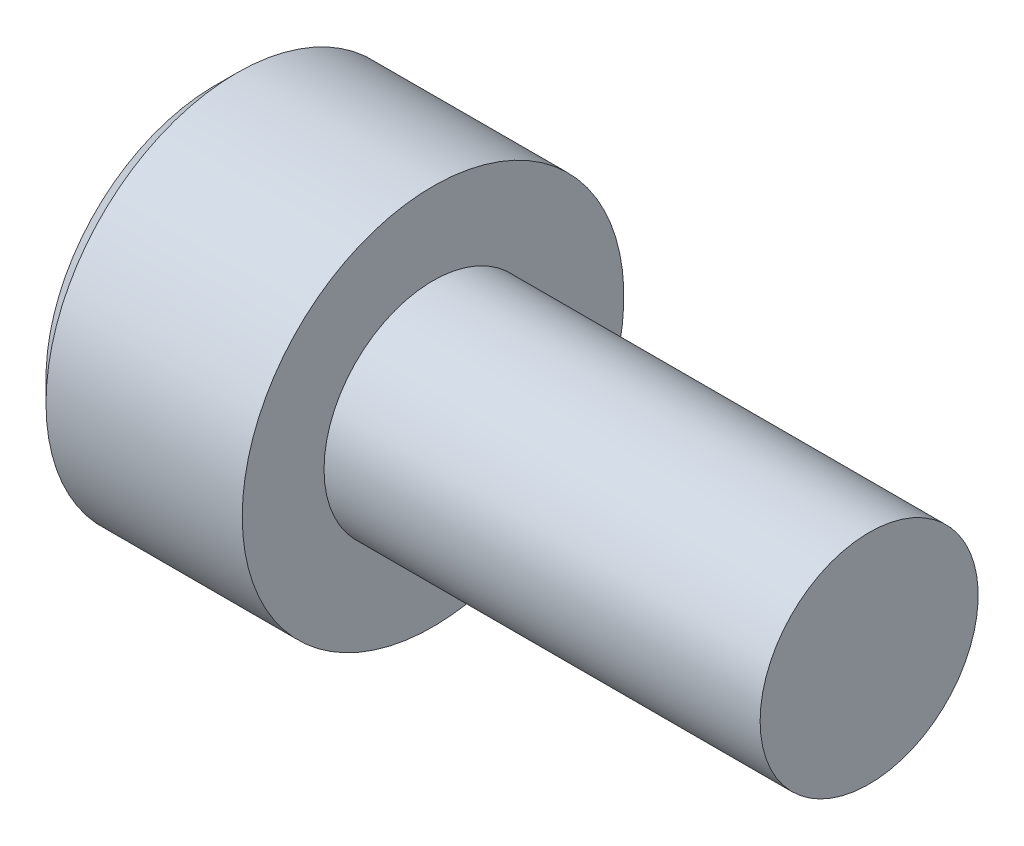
ISO-10303-21;
HEADER;
FILE_DESCRIPTION(('STEP AP214'),'2;1');
FILE_NAME('part.step','',(''),(''),'','','');
FILE_SCHEMA(('AUTOMOTIVE_DESIGN { 1 0 10303 214 1 1 1 1 }'));
ENDSEC;
DATA;
#1=APPLICATION_CONTEXT('core data for automotive mechanical design processes');
#2=APPLICATION_PROTOCOL_DEFINITION('international standard','automotive_design',2000,#1);
#3=PRODUCT_CONTEXT('',#1,'mechanical');
#4=PRODUCT('Part','Part','',(#3));
#5=PRODUCT_RELATED_PRODUCT_CATEGORY('part','',(#4));
#6=PRODUCT_DEFINITION_FORMATION('','',#4);
#7=PRODUCT_DEFINITION_CONTEXT('part definition',#1,'design');
#8=PRODUCT_DEFINITION('design','',#6,#7);
#9=PRODUCT_DEFINITION_SHAPE('','',#8);
#10=(LENGTH_UNIT() NAMED_UNIT(*) SI_UNIT(.MILLI.,.METRE.));
#11=(NAMED_UNIT(*) PLANE_ANGLE_UNIT() SI_UNIT($,.RADIAN.));
#12=(NAMED_UNIT(*) SI_UNIT($,.STERADIAN.) SOLID_ANGLE_UNIT());
#13=UNCERTAINTY_MEASURE_WITH_UNIT(LENGTH_MEASURE(1.E-05),#10,'distance_accuracy_value','');
#14=(GEOMETRIC_REPRESENTATION_CONTEXT(3) GLOBAL_UNCERTAINTY_ASSIGNED_CONTEXT((#13)) GLOBAL_UNIT_ASSIGNED_CONTEXT((#10,
#11,#12)) REPRESENTATION_CONTEXT('',''));
#15=CARTESIAN_POINT('',(0.,0.,0.));
#16=DIRECTION('',(0.,0.,1.));
#17=DIRECTION('',(1.,0.,0.));
#18=AXIS2_PLACEMENT_3D('',#15,#16,#17);
#19=CARTESIAN_POINT('',(-4.,3.5,0.));
#20=DIRECTION('',(1.,0.,0.));
#21=DIRECTION('',(0.,0.,-1.));
#22=AXIS2_PLACEMENT_3D('',#19,#20,#21);
#23=PLANE('',#22);
#24=CARTESIAN_POINT('',(-4.,0.,0.));
#25=DIRECTION('',(1.,0.,0.));
#26=DIRECTION('',(0.,0.,-1.));
#27=AXIS2_PLACEMENT_3D('',#24,#25,#26);
#28=CIRCLE('',#27,3.1);
#29=CARTESIAN_POINT('',(-4.,0.,-3.1));
#30=VERTEX_POINT('',#29);
#31=EDGE_CURVE('E45',#30,#30,#28,.F.);
#32=ORIENTED_EDGE('',*,*,#31,.T.);
#33=EDGE_LOOP('',(#32));
#34=FACE_BOUND('',#33,.T.);
#35=DIRECTION('',(0.,0.5,0.866025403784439));
#36=VECTOR('',#35,1.);
#37=CARTESIAN_POINT('',(-4.,-1.73205080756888,0.));
#38=LINE('',#37,#36);
#39=CARTESIAN_POINT('',(-4.,-1.73205080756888,0.));
#40=VERTEX_POINT('',#39);
#41=CARTESIAN_POINT('',(-4.,-0.866025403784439,1.5));
#42=VERTEX_POINT('',#41);
#43=EDGE_CURVE('E152',#40,#42,#38,.T.);
#44=ORIENTED_EDGE('',*,*,#43,.F.);
#45=DIRECTION('',(0.,-0.5,0.866025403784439));
#46=VECTOR('',#45,1.);
#47=CARTESIAN_POINT('',(-4.,-0.866025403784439,-1.5));
#48=LINE('',#47,#46);
#49=CARTESIAN_POINT('',(-4.,-0.866025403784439,-1.5));
#50=VERTEX_POINT('',#49);
#51=EDGE_CURVE('E52',#50,#40,#48,.T.);
#52=ORIENTED_EDGE('',*,*,#51,.F.);
#53=DIRECTION('',(0.,-1.,0.));
#54=VECTOR('',#53,1.);
#55=CARTESIAN_POINT('',(-4.,0.866025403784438,-1.5));
#56=LINE('',#55,#54);
#57=CARTESIAN_POINT('',(-4.,0.866025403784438,-1.5));
#58=VERTEX_POINT('',#57);
#59=EDGE_CURVE('E122',#58,#50,#56,.T.);
#60=ORIENTED_EDGE('',*,*,#59,.F.);
#61=DIRECTION('',(0.,-0.5,-0.866025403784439));
#62=VECTOR('',#61,1.);
#63=CARTESIAN_POINT('',(-4.,1.73205080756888,0.));
#64=LINE('',#63,#62);
#65=CARTESIAN_POINT('',(-4.,1.73205080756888,0.));
#66=VERTEX_POINT('',#65);
#67=EDGE_CURVE('E158',#66,#58,#64,.T.);
#68=ORIENTED_EDGE('',*,*,#67,.F.);
#69=DIRECTION('',(0.,0.499999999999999,-0.866025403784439));
#70=VECTOR('',#69,1.);
#71=CARTESIAN_POINT('',(-4.,0.866025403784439,1.5));
#72=LINE('',#71,#70);
#73=CARTESIAN_POINT('',(-4.,0.866025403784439,1.5));
#74=VERTEX_POINT('',#73);
#75=EDGE_CURVE('E156',#74,#66,#72,.T.);
#76=ORIENTED_EDGE('',*,*,#75,.F.);
#77=DIRECTION('',(0.,1.,0.));
#78=VECTOR('',#77,1.);
#79=CARTESIAN_POINT('',(-4.,-0.866025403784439,1.5));
#80=LINE('',#79,#78);
#81=EDGE_CURVE('E154',#42,#74,#80,.T.);
#82=ORIENTED_EDGE('',*,*,#81,.F.);
#83=EDGE_LOOP('',(#44,#52,#60,#68,#76,#82));
#84=FACE_BOUND('',#83,.T.);
#85=ADVANCED_FACE('F37',(#34,#84),#23,.F.);
#86=CARTESIAN_POINT('',(8.,0.,0.));
#87=DIRECTION('',(-1.,0.,0.));
#88=DIRECTION('',(0.,0.,1.));
#89=AXIS2_PLACEMENT_3D('',#86,#87,#88);
#90=PLANE('',#89);
#91=CARTESIAN_POINT('',(8.,0.,0.));
#92=DIRECTION('',(-1.,0.,0.));
#93=DIRECTION('',(0.,0.,1.));
#94=AXIS2_PLACEMENT_3D('',#91,#92,#93);
#95=CIRCLE('',#94,2.);
#96=CARTESIAN_POINT('',(8.,0.,2.));
#97=VERTEX_POINT('',#96);
#98=EDGE_CURVE('E184',#97,#97,#95,.T.);
#99=ORIENTED_EDGE('',*,*,#98,.F.);
#100=EDGE_LOOP('',(#99));
#101=FACE_BOUND('',#100,.T.);
#102=ADVANCED_FACE('F205',(#101),#90,.F.);
#103=CARTESIAN_POINT('',(-4.,0.,0.));
#104=DIRECTION('',(-1.,0.,0.));
#105=DIRECTION('',(0.,0.,1.));
#106=AXIS2_PLACEMENT_3D('',#103,#104,#105);
#107=CYLINDRICAL_SURFACE('',#106,2.);
#108=CARTESIAN_POINT('',(0.,0.,0.));
#109=DIRECTION('',(-1.,0.,0.));
#110=DIRECTION('',(0.,0.,1.));
#111=AXIS2_PLACEMENT_3D('',#108,#109,#110);
#112=CIRCLE('',#111,2.);
#113=CARTESIAN_POINT('',(0.,0.,2.));
#114=VERTEX_POINT('',#113);
#115=EDGE_CURVE('E181',#114,#114,#112,.T.);
#116=ORIENTED_EDGE('',*,*,#115,.F.);
#117=EDGE_LOOP('',(#116));
#118=FACE_BOUND('',#117,.T.);
#119=ORIENTED_EDGE('',*,*,#98,.T.);
#120=EDGE_LOOP('',(#119));
#121=FACE_BOUND('',#120,.T.);
#122=ADVANCED_FACE('F209',(#118,#121),#107,.T.);
#123=CARTESIAN_POINT('',(0.,2.,0.));
#124=DIRECTION('',(-1.,0.,0.));
#125=DIRECTION('',(0.,0.,1.));
#126=AXIS2_PLACEMENT_3D('',#123,#124,#125);
#127=PLANE('',#126);
#128=CARTESIAN_POINT('',(0.,0.,0.));
#129=DIRECTION('',(-1.,0.,0.));
#130=DIRECTION('',(0.,0.,1.));
#131=AXIS2_PLACEMENT_3D('',#128,#129,#130);
#132=CIRCLE('',#131,3.5);
#133=CARTESIAN_POINT('',(0.,0.,3.5));
#134=VERTEX_POINT('',#133);
#135=EDGE_CURVE('E177',#134,#134,#132,.T.);
#136=ORIENTED_EDGE('',*,*,#135,.F.);
#137=EDGE_LOOP('',(#136));
#138=FACE_BOUND('',#137,.T.);
#139=ORIENTED_EDGE('',*,*,#115,.T.);
#140=EDGE_LOOP('',(#139));
#141=FACE_BOUND('',#140,.T.);
#142=ADVANCED_FACE('F200',(#138,#141),#127,.F.);
#143=CARTESIAN_POINT('',(-4.,0.,0.));
#144=DIRECTION('',(-1.,0.,0.));
#145=DIRECTION('',(0.,0.,1.));
#146=AXIS2_PLACEMENT_3D('',#143,#144,#145);
#147=CYLINDRICAL_SURFACE('',#146,3.5);
#148=CARTESIAN_POINT('',(-3.6,0.,0.));
#149=DIRECTION('',(1.,0.,0.));
#150=DIRECTION('',(0.,0.,-1.));
#151=AXIS2_PLACEMENT_3D('',#148,#149,#150);
#152=CIRCLE('',#151,3.5);
#153=CARTESIAN_POINT('',(-3.6,0.,-3.5));
#154=VERTEX_POINT('',#153);
#155=EDGE_CURVE('E11',#154,#154,#152,.T.);
#156=ORIENTED_EDGE('',*,*,#155,.T.);
#157=EDGE_LOOP('',(#156));
#158=FACE_BOUND('',#157,.T.);
#159=ORIENTED_EDGE('',*,*,#135,.T.);
#160=EDGE_LOOP('',(#159));
#161=FACE_BOUND('',#160,.T.);
#162=ADVANCED_FACE('F192',(#158,#161),#147,.T.);
#163=CARTESIAN_POINT('',(-4.,0.,0.));
#164=DIRECTION('',(1.,0.,0.));
#165=DIRECTION('',(0.,0.,-1.));
#166=AXIS2_PLACEMENT_3D('',#163,#164,#165);
#167=CONICAL_SURFACE('',#166,3.1,0.785398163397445);
#168=ORIENTED_EDGE('',*,*,#155,.F.);
#169=EDGE_LOOP('',(#168));
#170=FACE_BOUND('',#169,.T.);
#171=ORIENTED_EDGE('',*,*,#31,.F.);
#172=EDGE_LOOP('',(#171));
#173=FACE_BOUND('',#172,.T.);
#174=ADVANCED_FACE('F39',(#170,#173),#167,.T.);
#175=CARTESIAN_POINT('',(-2.,-0.866025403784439,-1.5));
#176=DIRECTION('',(0.,-0.866025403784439,-0.5));
#177=DIRECTION('',(0.,0.5,-0.866025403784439));
#178=AXIS2_PLACEMENT_3D('',#175,#176,#177);
#179=PLANE('',#178);
#180=DIRECTION('',(0.,-0.5,0.866025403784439));
#181=VECTOR('',#180,1.);
#182=CARTESIAN_POINT('',(-2.,-0.866025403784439,-1.5));
#183=LINE('',#182,#181);
#184=CARTESIAN_POINT('',(-2.,-0.866025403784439,-1.5));
#185=VERTEX_POINT('',#184);
#186=CARTESIAN_POINT('',(-2.,-1.29903810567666,-0.75));
#187=VERTEX_POINT('',#186);
#188=EDGE_CURVE('E121',#185,#187,#183,.T.);
#189=ORIENTED_EDGE('',*,*,#188,.F.);
#190=DIRECTION('',(-1.,0.,0.));
#191=VECTOR('',#190,1.);
#192=CARTESIAN_POINT('',(-2.,-0.866025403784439,-1.5));
#193=LINE('',#192,#191);
#194=EDGE_CURVE('E161',#185,#50,#193,.T.);
#195=ORIENTED_EDGE('',*,*,#194,.T.);
#196=ORIENTED_EDGE('',*,*,#51,.T.);
#197=DIRECTION('',(-1.,0.,0.));
#198=VECTOR('',#197,1.);
#199=CARTESIAN_POINT('',(-2.,-1.73205080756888,0.));
#200=LINE('',#199,#198);
#201=CARTESIAN_POINT('',(-2.,-1.73205080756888,0.));
#202=VERTEX_POINT('',#201);
#203=EDGE_CURVE('E124',#202,#40,#200,.T.);
#204=ORIENTED_EDGE('',*,*,#203,.F.);
#205=EDGE_CURVE('E113',#187,#202,#183,.T.);
#206=ORIENTED_EDGE('',*,*,#205,.F.);
#207=EDGE_LOOP('',(#189,#195,#196,#204,#206));
#208=FACE_BOUND('',#207,.T.);
#209=ADVANCED_FACE('F125',(#208),#179,.F.);
#210=CARTESIAN_POINT('',(-2.,0.866025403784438,-1.5));
#211=DIRECTION('',(0.,0.,-1.));
#212=DIRECTION('',(-1.,0.,0.));
#213=AXIS2_PLACEMENT_3D('',#210,#211,#212);
#214=PLANE('',#213);
#215=DIRECTION('',(0.,-1.,0.));
#216=VECTOR('',#215,1.);
#217=CARTESIAN_POINT('',(-2.,0.866025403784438,-1.5));
#218=LINE('',#217,#216);
#219=CARTESIAN_POINT('',(-2.,0.866025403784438,-1.5));
#220=VERTEX_POINT('',#219);
#221=CARTESIAN_POINT('',(-2.,0.,-1.5));
#222=VERTEX_POINT('',#221);
#223=EDGE_CURVE('E130',#220,#222,#218,.T.);
#224=ORIENTED_EDGE('',*,*,#223,.F.);
#225=DIRECTION('',(-1.,0.,0.));
#226=VECTOR('',#225,1.);
#227=CARTESIAN_POINT('',(-2.,0.866025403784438,-1.5));
#228=LINE('',#227,#226);
#229=EDGE_CURVE('E163',#220,#58,#228,.T.);
#230=ORIENTED_EDGE('',*,*,#229,.T.);
#231=ORIENTED_EDGE('',*,*,#59,.T.);
#232=ORIENTED_EDGE('',*,*,#194,.F.);
#233=EDGE_CURVE('E148',#222,#185,#218,.T.);
#234=ORIENTED_EDGE('',*,*,#233,.F.);
#235=EDGE_LOOP('',(#224,#230,#231,#232,#234));
#236=FACE_BOUND('',#235,.T.);
#237=ADVANCED_FACE('F198',(#236),#214,.F.);
#238=CARTESIAN_POINT('',(-2.,1.73205080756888,0.));
#239=DIRECTION('',(0.,0.866025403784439,-0.5));
#240=DIRECTION('',(0.,0.5,0.866025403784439));
#241=AXIS2_PLACEMENT_3D('',#238,#239,#240);
#242=PLANE('',#241);
#243=DIRECTION('',(0.,-0.5,-0.866025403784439));
#244=VECTOR('',#243,1.);
#245=CARTESIAN_POINT('',(-2.,1.73205080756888,0.));
#246=LINE('',#245,#244);
#247=CARTESIAN_POINT('',(-2.,1.73205080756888,0.));
#248=VERTEX_POINT('',#247);
#249=CARTESIAN_POINT('',(-2.,1.29903810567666,-0.75));
#250=VERTEX_POINT('',#249);
#251=EDGE_CURVE('E145',#248,#250,#246,.T.);
#252=ORIENTED_EDGE('',*,*,#251,.F.);
#253=DIRECTION('',(-1.,0.,0.));
#254=VECTOR('',#253,1.);
#255=CARTESIAN_POINT('',(-2.,1.73205080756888,0.));
#256=LINE('',#255,#254);
#257=EDGE_CURVE('E166',#248,#66,#256,.T.);
#258=ORIENTED_EDGE('',*,*,#257,.T.);
#259=ORIENTED_EDGE('',*,*,#67,.T.);
#260=ORIENTED_EDGE('',*,*,#229,.F.);
#261=EDGE_CURVE('E144',#250,#220,#246,.T.);
#262=ORIENTED_EDGE('',*,*,#261,.F.);
#263=EDGE_LOOP('',(#252,#258,#259,#260,#262));
#264=FACE_BOUND('',#263,.T.);
#265=ADVANCED_FACE('F234',(#264),#242,.F.);
#266=CARTESIAN_POINT('',(-2.,0.866025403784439,1.5));
#267=DIRECTION('',(0.,0.866025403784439,0.5));
#268=DIRECTION('',(0.,-0.5,0.866025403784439));
#269=AXIS2_PLACEMENT_3D('',#266,#267,#268);
#270=PLANE('',#269);
#271=DIRECTION('',(0.,0.499999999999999,-0.866025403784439));
#272=VECTOR('',#271,1.);
#273=CARTESIAN_POINT('',(-2.,0.866025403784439,1.5));
#274=LINE('',#273,#272);
#275=CARTESIAN_POINT('',(-2.,0.866025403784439,1.5));
#276=VERTEX_POINT('',#275);
#277=CARTESIAN_POINT('',(-2.,1.29903810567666,0.749999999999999));
#278=VERTEX_POINT('',#277);
#279=EDGE_CURVE('E141',#276,#278,#274,.T.);
#280=ORIENTED_EDGE('',*,*,#279,.F.);
#281=DIRECTION('',(-1.,0.,0.));
#282=VECTOR('',#281,1.);
#283=CARTESIAN_POINT('',(-2.,0.866025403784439,1.5));
#284=LINE('',#283,#282);
#285=EDGE_CURVE('E169',#276,#74,#284,.T.);
#286=ORIENTED_EDGE('',*,*,#285,.T.);
#287=ORIENTED_EDGE('',*,*,#75,.T.);
#288=ORIENTED_EDGE('',*,*,#257,.F.);
#289=EDGE_CURVE('E140',#278,#248,#274,.T.);
#290=ORIENTED_EDGE('',*,*,#289,.F.);
#291=EDGE_LOOP('',(#280,#286,#287,#288,#290));
#292=FACE_BOUND('',#291,.T.);
#293=ADVANCED_FACE('F230',(#292),#270,.F.);
#294=CARTESIAN_POINT('',(-2.,-0.866025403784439,1.5));
#295=DIRECTION('',(0.,0.,1.));
#296=DIRECTION('',(1.,0.,0.));
#297=AXIS2_PLACEMENT_3D('',#294,#295,#296);
#298=PLANE('',#297);
#299=DIRECTION('',(0.,1.,0.));
#300=VECTOR('',#299,1.);
#301=CARTESIAN_POINT('',(-2.,-0.866025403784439,1.5));
#302=LINE('',#301,#300);
#303=CARTESIAN_POINT('',(-2.,-0.866025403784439,1.5));
#304=VERTEX_POINT('',#303);
#305=CARTESIAN_POINT('',(-2.,0.,1.5));
#306=VERTEX_POINT('',#305);
#307=EDGE_CURVE('E60',#304,#306,#302,.T.);
#308=ORIENTED_EDGE('',*,*,#307,.F.);
#309=DIRECTION('',(-1.,0.,0.));
#310=VECTOR('',#309,1.);
#311=CARTESIAN_POINT('',(-2.,-0.866025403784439,1.5));
#312=LINE('',#311,#310);
#313=EDGE_CURVE('E129',#304,#42,#312,.T.);
#314=ORIENTED_EDGE('',*,*,#313,.T.);
#315=ORIENTED_EDGE('',*,*,#81,.T.);
#316=ORIENTED_EDGE('',*,*,#285,.F.);
#317=EDGE_CURVE('E136',#306,#276,#302,.T.);
#318=ORIENTED_EDGE('',*,*,#317,.F.);
#319=EDGE_LOOP('',(#308,#314,#315,#316,#318));
#320=FACE_BOUND('',#319,.T.);
#321=ADVANCED_FACE('F227',(#320),#298,.F.);
#322=CARTESIAN_POINT('',(-2.,-1.73205080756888,0.));
#323=DIRECTION('',(0.,-0.866025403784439,0.5));
#324=DIRECTION('',(0.,-0.5,-0.866025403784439));
#325=AXIS2_PLACEMENT_3D('',#322,#323,#324);
#326=PLANE('',#325);
#327=DIRECTION('',(0.,0.5,0.866025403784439));
#328=VECTOR('',#327,1.);
#329=CARTESIAN_POINT('',(-2.,-1.73205080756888,0.));
#330=LINE('',#329,#328);
#331=CARTESIAN_POINT('',(-2.,-1.29903810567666,0.750000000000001));
#332=VERTEX_POINT('',#331);
#333=EDGE_CURVE('E116',#202,#332,#330,.T.);
#334=ORIENTED_EDGE('',*,*,#333,.F.);
#335=ORIENTED_EDGE('',*,*,#203,.T.);
#336=ORIENTED_EDGE('',*,*,#43,.T.);
#337=ORIENTED_EDGE('',*,*,#313,.F.);
#338=EDGE_CURVE('E135',#332,#304,#330,.T.);
#339=ORIENTED_EDGE('',*,*,#338,.F.);
#340=EDGE_LOOP('',(#334,#335,#336,#337,#339));
#341=FACE_BOUND('',#340,.T.);
#342=ADVANCED_FACE('F133',(#341),#326,.F.);
#343=CARTESIAN_POINT('',(-2.,0.,0.));
#344=DIRECTION('',(-1.,0.,0.));
#345=DIRECTION('',(0.,0.,1.));
#346=AXIS2_PLACEMENT_3D('',#343,#344,#345);
#347=PLANE('',#346);
#348=ORIENTED_EDGE('',*,*,#317,.T.);
#349=ORIENTED_EDGE('',*,*,#279,.T.);
#350=CARTESIAN_POINT('',(-2.,0.,0.));
#351=DIRECTION('',(-1.,0.,0.));
#352=DIRECTION('',(0.,-1.,0.));
#353=AXIS2_PLACEMENT_3D('',#350,#351,#352);
#354=CIRCLE('',#353,1.5);
#355=EDGE_CURVE('E178',#306,#278,#354,.T.);
#356=ORIENTED_EDGE('',*,*,#355,.F.);
#357=EDGE_LOOP('',(#348,#349,#356));
#358=FACE_BOUND('',#357,.T.);
#359=ADVANCED_FACE('F226',(#358),#347,.T.);
#360=ORIENTED_EDGE('',*,*,#289,.T.);
#361=ORIENTED_EDGE('',*,*,#251,.T.);
#362=EDGE_CURVE('E264',#278,#250,#354,.T.);
#363=ORIENTED_EDGE('',*,*,#362,.F.);
#364=EDGE_LOOP('',(#360,#361,#363));
#365=FACE_BOUND('',#364,.T.);
#366=ADVANCED_FACE('F248',(#365),#347,.T.);
#367=ORIENTED_EDGE('',*,*,#261,.T.);
#368=ORIENTED_EDGE('',*,*,#223,.T.);
#369=EDGE_CURVE('E266',#250,#222,#354,.T.);
#370=ORIENTED_EDGE('',*,*,#369,.F.);
#371=EDGE_LOOP('',(#367,#368,#370));
#372=FACE_BOUND('',#371,.T.);
#373=ADVANCED_FACE('F253',(#372),#347,.T.);
#374=ORIENTED_EDGE('',*,*,#233,.T.);
#375=ORIENTED_EDGE('',*,*,#188,.T.);
#376=EDGE_CURVE('E267',#222,#187,#354,.T.);
#377=ORIENTED_EDGE('',*,*,#376,.F.);
#378=EDGE_LOOP('',(#374,#375,#377));
#379=FACE_BOUND('',#378,.T.);
#380=ADVANCED_FACE('F246',(#379),#347,.T.);
#381=ORIENTED_EDGE('',*,*,#205,.T.);
#382=ORIENTED_EDGE('',*,*,#333,.T.);
#383=EDGE_CURVE('E118',#187,#332,#354,.T.);
#384=ORIENTED_EDGE('',*,*,#383,.F.);
#385=EDGE_LOOP('',(#381,#382,#384));
#386=FACE_BOUND('',#385,.T.);
#387=ADVANCED_FACE('F114',(#386),#347,.T.);
#388=ORIENTED_EDGE('',*,*,#338,.T.);
#389=ORIENTED_EDGE('',*,*,#307,.T.);
#390=EDGE_CURVE('E174',#332,#306,#354,.T.);
#391=ORIENTED_EDGE('',*,*,#390,.F.);
#392=EDGE_LOOP('',(#388,#389,#391));
#393=FACE_BOUND('',#392,.T.);
#394=ADVANCED_FACE('F221',(#393),#347,.T.);
#395=CARTESIAN_POINT('',(-1.09870907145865,0.,0.));
#396=DIRECTION('',(-1.,0.,0.));
#397=DIRECTION('',(0.,-1.,0.));
#398=AXIS2_PLACEMENT_3D('',#395,#396,#397);
#399=CONICAL_SURFACE('',#398,0.,1.02974425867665);
#400=ORIENTED_EDGE('',*,*,#390,.T.);
#401=ORIENTED_EDGE('',*,*,#355,.T.);
#402=ORIENTED_EDGE('',*,*,#362,.T.);
#403=ORIENTED_EDGE('',*,*,#369,.T.);
#404=ORIENTED_EDGE('',*,*,#376,.T.);
#405=ORIENTED_EDGE('',*,*,#383,.T.);
#406=EDGE_LOOP('',(#400,#401,#402,#403,#404,#405));
#407=FACE_BOUND('',#406,.T.);
#408=CARTESIAN_POINT('',(-1.09870907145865,0.,0.));
#409=VERTEX_POINT('',#408);
#410=VERTEX_LOOP('',#409);
#411=FACE_BOUND('',#410,.T.);
#412=ADVANCED_FACE('F219',(#407,#411),#399,.F.);
#413=CLOSED_SHELL('',(#85,#102,#122,#142,#162,#174,#209,#237,#265,#293,#321,#342,#359,#366,#373,
#380,#387,#394,#412));
#414=MANIFOLD_SOLID_BREP('B2',#413);
#415=ADVANCED_BREP_SHAPE_REPRESENTATION('',(#18,#414),#14);
#416=SHAPE_DEFINITION_REPRESENTATION(#9,#415);
ENDSEC;
END-ISO-10303-21;
